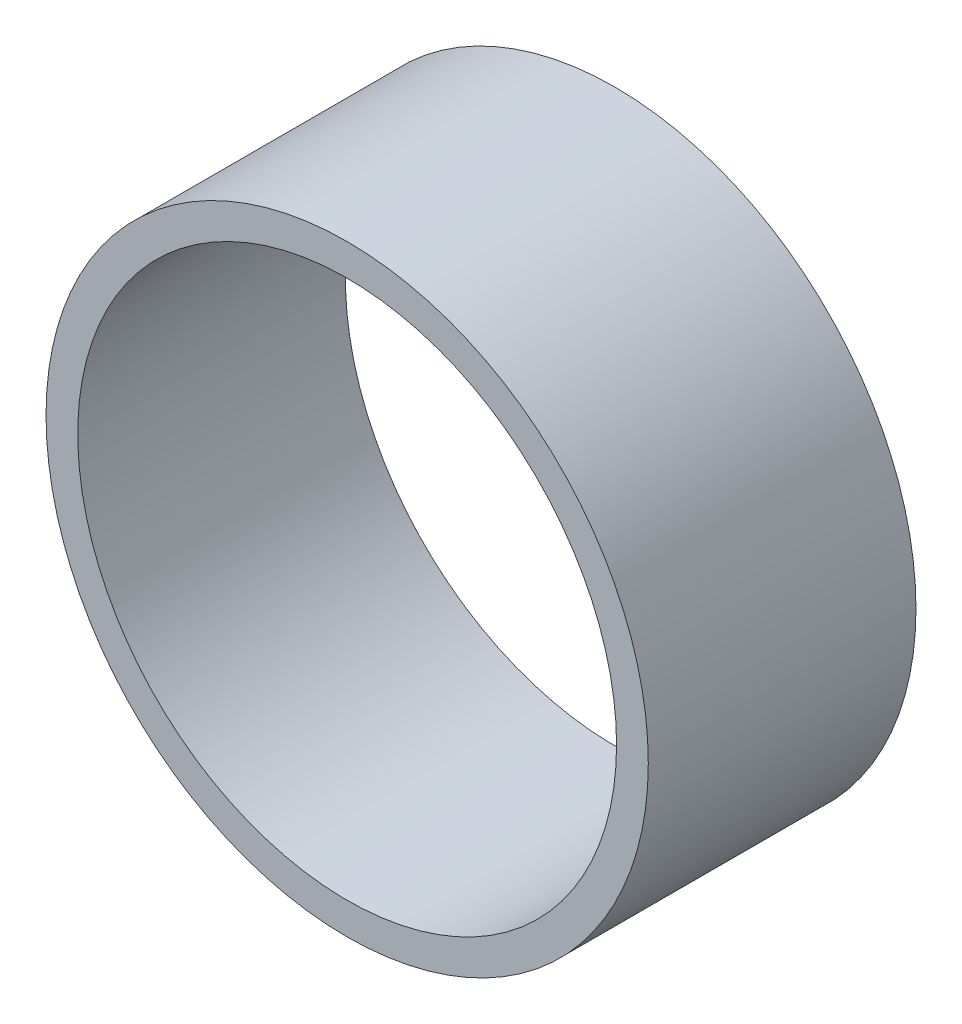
ISO-10303-21;
HEADER;
FILE_DESCRIPTION(('STEP AP214'),'2;1');
FILE_NAME('part.step','',(''),(''),'','','');
FILE_SCHEMA(('AUTOMOTIVE_DESIGN { 1 0 10303 214 1 1 1 1 }'));
ENDSEC;
DATA;
#1=APPLICATION_CONTEXT('core data for automotive mechanical design processes');
#2=APPLICATION_PROTOCOL_DEFINITION('international standard','automotive_design',2000,#1);
#3=PRODUCT_CONTEXT('',#1,'mechanical');
#4=PRODUCT('Part','Part','',(#3));
#5=PRODUCT_RELATED_PRODUCT_CATEGORY('part','',(#4));
#6=PRODUCT_DEFINITION_FORMATION('','',#4);
#7=PRODUCT_DEFINITION_CONTEXT('part definition',#1,'design');
#8=PRODUCT_DEFINITION('design','',#6,#7);
#9=PRODUCT_DEFINITION_SHAPE('','',#8);
#10=(LENGTH_UNIT() NAMED_UNIT(*) SI_UNIT(.MILLI.,.METRE.));
#11=(NAMED_UNIT(*) PLANE_ANGLE_UNIT() SI_UNIT($,.RADIAN.));
#12=(NAMED_UNIT(*) SI_UNIT($,.STERADIAN.) SOLID_ANGLE_UNIT());
#13=UNCERTAINTY_MEASURE_WITH_UNIT(LENGTH_MEASURE(1.E-05),#10,'distance_accuracy_value','');
#14=(GEOMETRIC_REPRESENTATION_CONTEXT(3) GLOBAL_UNCERTAINTY_ASSIGNED_CONTEXT((#13)) GLOBAL_UNIT_ASSIGNED_CONTEXT((#10,
#11,#12)) REPRESENTATION_CONTEXT('',''));
#15=CARTESIAN_POINT('',(0.,0.,0.));
#16=DIRECTION('',(0.,0.,1.));
#17=DIRECTION('',(1.,0.,0.));
#18=AXIS2_PLACEMENT_3D('',#15,#16,#17);
#19=CARTESIAN_POINT('',(0.,0.,50.8));
#20=DIRECTION('',(0.,0.,1.));
#21=DIRECTION('',(1.,0.,0.));
#22=AXIS2_PLACEMENT_3D('',#19,#20,#21);
#23=PLANE('',#22);
#24=CARTESIAN_POINT('',(0.,0.,50.8));
#25=DIRECTION('',(0.,0.,1.));
#26=DIRECTION('',(1.,0.,0.));
#27=AXIS2_PLACEMENT_3D('',#24,#25,#26);
#28=CIRCLE('',#27,57.15);
#29=CARTESIAN_POINT('',(57.15,0.,50.8));
#30=VERTEX_POINT('',#29);
#31=EDGE_CURVE('E10',#30,#30,#28,.T.);
#32=ORIENTED_EDGE('',*,*,#31,.T.);
#33=EDGE_LOOP('',(#32));
#34=FACE_BOUND('',#33,.T.);
#35=CARTESIAN_POINT('',(0.,0.,50.8));
#36=DIRECTION('',(0.,0.,1.));
#37=DIRECTION('',(1.,0.,0.));
#38=AXIS2_PLACEMENT_3D('',#35,#36,#37);
#39=CIRCLE('',#38,51.1302);
#40=CARTESIAN_POINT('',(51.1302,0.,50.8));
#41=VERTEX_POINT('',#40);
#42=EDGE_CURVE('E41',#41,#41,#39,.T.);
#43=ORIENTED_EDGE('',*,*,#42,.F.);
#44=EDGE_LOOP('',(#43));
#45=FACE_BOUND('',#44,.T.);
#46=ADVANCED_FACE('F30',(#34,#45),#23,.T.);
#47=CARTESIAN_POINT('',(0.,0.,0.));
#48=DIRECTION('',(0.,0.,1.));
#49=DIRECTION('',(1.,0.,0.));
#50=AXIS2_PLACEMENT_3D('',#47,#48,#49);
#51=PLANE('',#50);
#52=CARTESIAN_POINT('',(0.,0.,0.));
#53=DIRECTION('',(0.,0.,1.));
#54=DIRECTION('',(1.,0.,0.));
#55=AXIS2_PLACEMENT_3D('',#52,#53,#54);
#56=CIRCLE('',#55,57.15);
#57=CARTESIAN_POINT('',(57.15,0.,0.));
#58=VERTEX_POINT('',#57);
#59=EDGE_CURVE('E37',#58,#58,#56,.T.);
#60=ORIENTED_EDGE('',*,*,#59,.F.);
#61=EDGE_LOOP('',(#60));
#62=FACE_BOUND('',#61,.T.);
#63=CARTESIAN_POINT('',(0.,0.,0.));
#64=DIRECTION('',(0.,0.,1.));
#65=DIRECTION('',(1.,0.,0.));
#66=AXIS2_PLACEMENT_3D('',#63,#64,#65);
#67=CIRCLE('',#66,51.1302);
#68=CARTESIAN_POINT('',(51.1302,0.,0.));
#69=VERTEX_POINT('',#68);
#70=EDGE_CURVE('E45',#69,#69,#67,.T.);
#71=ORIENTED_EDGE('',*,*,#70,.T.);
#72=EDGE_LOOP('',(#71));
#73=FACE_BOUND('',#72,.T.);
#74=ADVANCED_FACE('F51',(#62,#73),#51,.F.);
#75=CARTESIAN_POINT('',(0.,0.,50.8));
#76=DIRECTION('',(0.,0.,-1.));
#77=DIRECTION('',(-1.,0.,0.));
#78=AXIS2_PLACEMENT_3D('',#75,#76,#77);
#79=CYLINDRICAL_SURFACE('',#78,57.15);
#80=ORIENTED_EDGE('',*,*,#31,.F.);
#81=EDGE_LOOP('',(#80));
#82=FACE_BOUND('',#81,.T.);
#83=ORIENTED_EDGE('',*,*,#59,.T.);
#84=EDGE_LOOP('',(#83));
#85=FACE_BOUND('',#84,.T.);
#86=ADVANCED_FACE('F32',(#82,#85),#79,.T.);
#87=CARTESIAN_POINT('',(0.,0.,50.8));
#88=DIRECTION('',(0.,0.,-1.));
#89=DIRECTION('',(-1.,0.,0.));
#90=AXIS2_PLACEMENT_3D('',#87,#88,#89);
#91=CYLINDRICAL_SURFACE('',#90,51.1302);
#92=ORIENTED_EDGE('',*,*,#42,.T.);
#93=EDGE_LOOP('',(#92));
#94=FACE_BOUND('',#93,.T.);
#95=ORIENTED_EDGE('',*,*,#70,.F.);
#96=EDGE_LOOP('',(#95));
#97=FACE_BOUND('',#96,.T.);
#98=ADVANCED_FACE('F53',(#94,#97),#91,.F.);
#99=CLOSED_SHELL('',(#46,#74,#86,#98));
#100=MANIFOLD_SOLID_BREP('B2',#99);
#101=ADVANCED_BREP_SHAPE_REPRESENTATION('',(#18,#100),#14);
#102=SHAPE_DEFINITION_REPRESENTATION(#9,#101);
ENDSEC;
END-ISO-10303-21;
